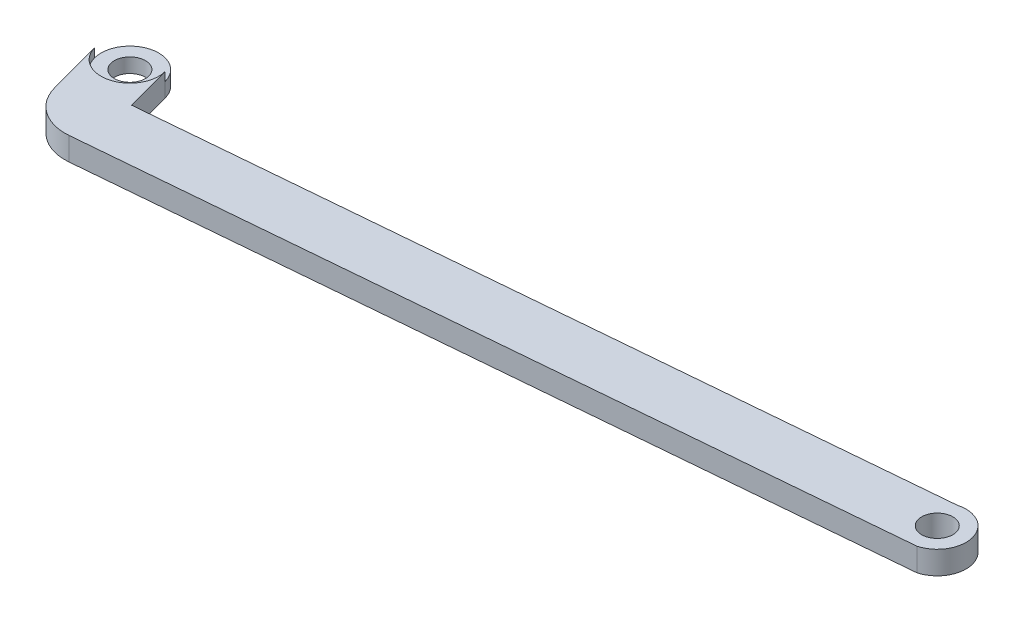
from build123d import *

# Parameters (mm, degrees)
SKETCH1_R           = 3.429
BOSS_EXTRUDE1_DEPTH = 5.08
CUT_EXTRUDE1_START  = -1.905
SKETCH2_R           = 6.35
CUT_EXTRUDE1_DEPTH  = 1.905


with BuildPart() as part:
    # Sketch1 → Boss-Extrude1 (new body)
    with BuildSketch(Plane(origin=(0, 0, 0), x_dir=(1, 0, 0), z_dir=(0, 1, 0))):
        with BuildLine():
            Line((-183.933628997, -1.643500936), (-180.713811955, -13.660021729))
            ThreePointArc((-180.713811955, -13.660021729), (-176.727542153, -19.353005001), (-170.014503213, -21.151758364))
            Line((-170.014503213, -21.151758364), (1.643500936, -6.133628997))
            ThreePointArc((1.643500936, -6.133628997), (6.133628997, 1.643500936), (-1.643500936, 6.133628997))
            Line((-1.643500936, 6.133628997), (-168.94747107, -8.503571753))
            Line((-168.94747107, -8.503571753), (-171.666371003, 1.643500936))
            ThreePointArc((-171.666371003, 1.643500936), (-179.443500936, 6.133628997), (-183.933628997, -1.643500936))
        make_face()
        with Locations(Location((0, 0, 0), (0, 0, 270))):
            Circle(SKETCH1_R, mode=Mode.SUBTRACT)
        with Locations(Location((-177.8, 0, 0), (0, 0, 270))):
            Circle(SKETCH1_R, mode=Mode.SUBTRACT)
    extrude(amount=BOSS_EXTRUDE1_DEPTH)

    # Sketch2 → Cut-Extrude1 (cut)
    with BuildSketch(Plane(origin=(0, 5.08, 0), x_dir=(1, 0, 0), z_dir=(0, 1, 0)).offset(CUT_EXTRUDE1_START)):
        with Locations((-177.8, 0)):
            Circle(SKETCH2_R)
    extrude(amount=CUT_EXTRUDE1_DEPTH, mode=Mode.SUBTRACT)


solid = part.part
